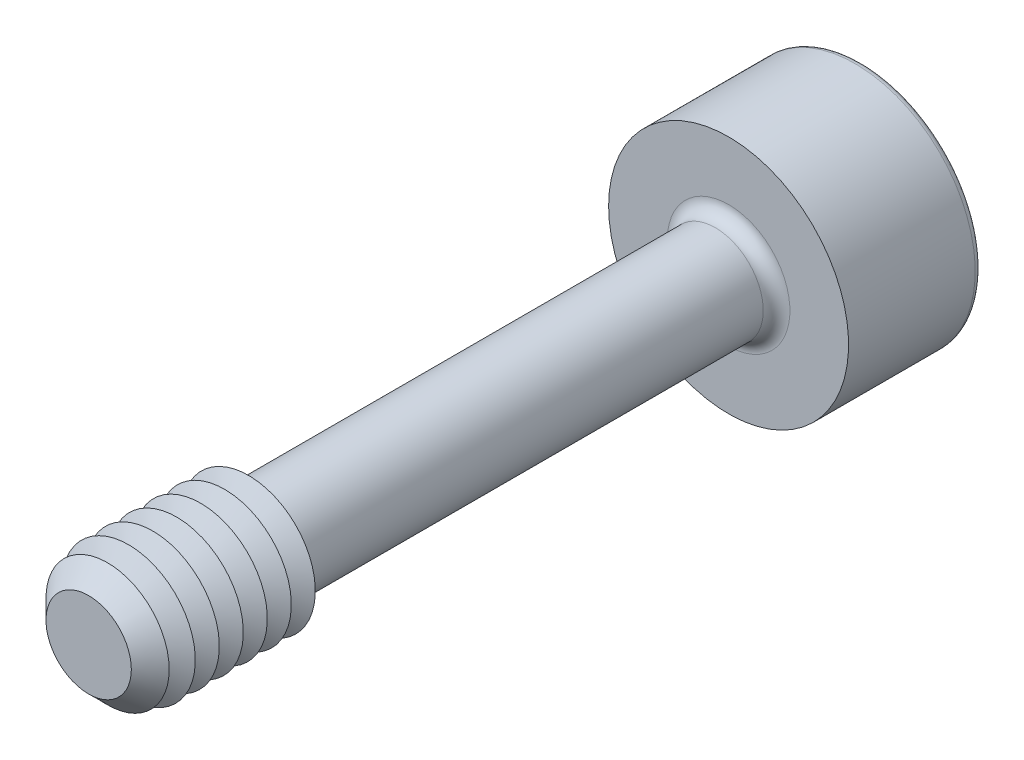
from build123d import *

# Parameters (mm, degrees)
SKETCH1_R       = 0.9
EXTRUDE1_DEPTH  = 6
CHAMFER1_SIZE   = 0.45
SKETCH3_R       = 2.25
EXTRUDE2_DEPTH  = 2.5
EXTRUDE3_DEPTH  = 2
FILLET1_R       = 0.25
FILLET2_R       = 0.125
LPATTERN1_COUNT = 6
LPATTERN1_PITCH = 0.45


with BuildPart() as part:
    # Sketch1 → Extrude1 (new, symmetric)
    with BuildSketch(Plane.XY):
        Circle(SKETCH1_R)
    extrude(amount=EXTRUDE1_DEPTH, both=True)

    # Sketch2 → Revolve1 (revolve)
    with BuildSketch(Plane(origin=(0, 0, 0), x_dir=(0, 0, -1), z_dir=(1, 0, 0))):
        Polygon((-6, 0), (-6, 1.25), (-3, 1.25), (-2.797927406, 0.9), (-2.797927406, 0), align=None)
    revolve(axis=Axis((0, 0, 2.797927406), (0, 0, 1)))

    # Chamfer1
    chamfer1_edges = [part.edges().sort_by_distance(p)[0] for p in [
        (0, -1.25, 6),
    ]]
    chamfer(chamfer1_edges, length=CHAMFER1_SIZE)

    # Sketch3 → Extrude2 (add)
    with BuildSketch(Plane(origin=(0, 0, -6), x_dir=(-1, 0, 0), z_dir=(0, 0, -1))):
        Circle(SKETCH3_R)
    extrude(amount=EXTRUDE2_DEPTH)

    # Sketch4 → Extrude3 (cut)
    with BuildSketch(Plane(origin=(-13.7, 0, -8.5), x_dir=(1, 0, 0), z_dir=(0, 0, 1))):
        Polygon((13.122649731, -1), (14.277350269, -1), (14.854700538, 0), (14.277350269, 1), (13.122649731, 1), (12.545299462, 0), align=None)
    extrude(amount=EXTRUDE3_DEPTH, mode=Mode.SUBTRACT)

    # Fillet1
    fillet1_edges = [part.edges().sort_by_distance(p)[0] for p in [
        (-0.9, 0, -6),
    ]]
    fillet(fillet1_edges, radius=FILLET1_R)

    # Fillet2
    fillet2_edges = [part.edges().sort_by_distance(p)[0] for p in [
        (2.25, 0, -8.5),
    ]]
    fillet(fillet2_edges, radius=FILLET2_R)

    # Sketch5 → Cut-Revolve1 (revolve, cut)
    with BuildSketch(Plane(origin=(0, 0, 0), x_dir=(0, 0, -1), z_dir=(1, 0, 0)), mode=Mode.PRIVATE) as cut_revolve1_sk:
        Polygon((6.5, 0), (6.5, -1), (5.922649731, 0), align=None)
    revolve(cut_revolve1_sk.sketch.rotate(Axis((0, 0, -5.922649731), (0, 0, -1)), 90), axis=Axis((0, 0, -5.922649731), (0, 0, -1)), mode=Mode.SUBTRACT)

    # Sketch7 → Cut-Revolve2 (revolve, cut)
    with BuildSketch(Plane(origin=(0, 0, 0), x_dir=(0, 0, -1), z_dir=(1, 0, 0)), mode=Mode.PRIVATE) as cut_revolve2_sk:
        Polygon((-3, 1.25), (-3.225, 0.860288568), (-3.45, 1.25), align=None)
    cut_revolve2 = revolve(cut_revolve2_sk.sketch.rotate(Axis((0, 0, -1.332048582), (0, 0, 1)), 90), axis=Axis((0, 0, -1.332048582), (0, 0, 1)), mode=Mode.SUBTRACT)

    # LPattern1: Cut-Revolve2 ×6
    with Locations(*[(0, 0, i * LPATTERN1_PITCH) for i in range(1, LPATTERN1_COUNT)]):
        add(cut_revolve2, mode=Mode.SUBTRACT)


solid = part.part
